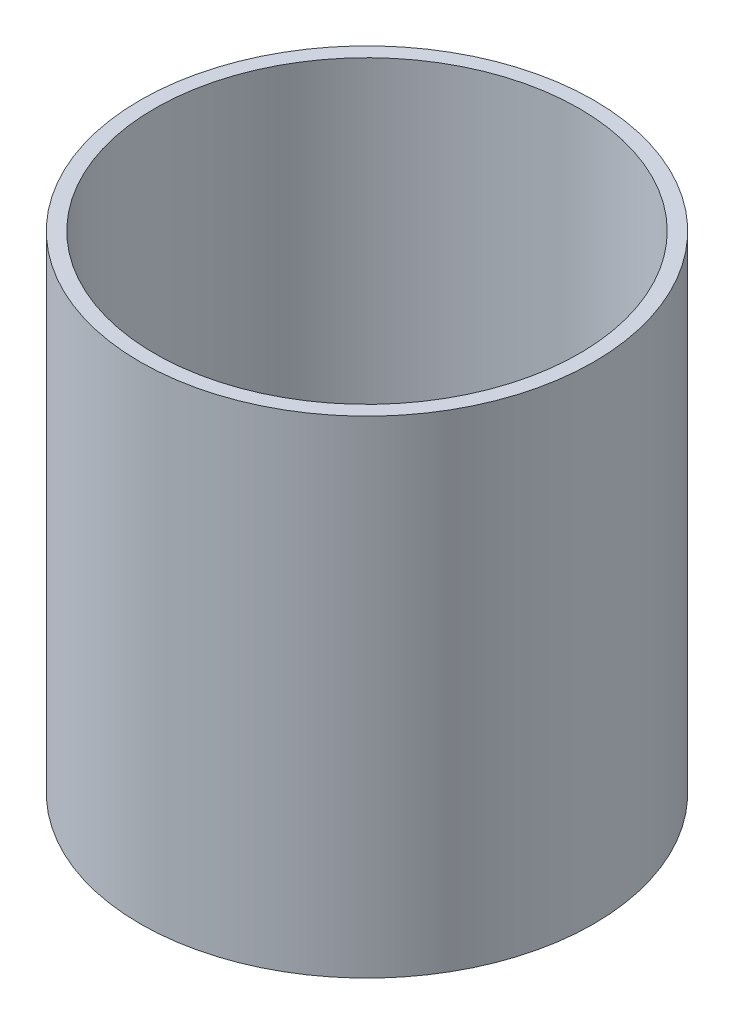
ISO-10303-21;
HEADER;
FILE_DESCRIPTION(('STEP AP214'),'2;1');
FILE_NAME('part.step','',(''),(''),'','','');
FILE_SCHEMA(('AUTOMOTIVE_DESIGN { 1 0 10303 214 1 1 1 1 }'));
ENDSEC;
DATA;
#1=APPLICATION_CONTEXT('core data for automotive mechanical design processes');
#2=APPLICATION_PROTOCOL_DEFINITION('international standard','automotive_design',2000,#1);
#3=PRODUCT_CONTEXT('',#1,'mechanical');
#4=PRODUCT('Part','Part','',(#3));
#5=PRODUCT_RELATED_PRODUCT_CATEGORY('part','',(#4));
#6=PRODUCT_DEFINITION_FORMATION('','',#4);
#7=PRODUCT_DEFINITION_CONTEXT('part definition',#1,'design');
#8=PRODUCT_DEFINITION('design','',#6,#7);
#9=PRODUCT_DEFINITION_SHAPE('','',#8);
#10=(LENGTH_UNIT() NAMED_UNIT(*) SI_UNIT(.MILLI.,.METRE.));
#11=(NAMED_UNIT(*) PLANE_ANGLE_UNIT() SI_UNIT($,.RADIAN.));
#12=(NAMED_UNIT(*) SI_UNIT($,.STERADIAN.) SOLID_ANGLE_UNIT());
#13=UNCERTAINTY_MEASURE_WITH_UNIT(LENGTH_MEASURE(1.E-05),#10,'distance_accuracy_value','');
#14=(GEOMETRIC_REPRESENTATION_CONTEXT(3) GLOBAL_UNCERTAINTY_ASSIGNED_CONTEXT((#13)) GLOBAL_UNIT_ASSIGNED_CONTEXT((#10,
#11,#12)) REPRESENTATION_CONTEXT('',''));
#15=CARTESIAN_POINT('',(0.,0.,0.));
#16=DIRECTION('',(0.,0.,1.));
#17=DIRECTION('',(1.,0.,0.));
#18=AXIS2_PLACEMENT_3D('',#15,#16,#17);
#19=CARTESIAN_POINT('',(0.,44.831,0.));
#20=DIRECTION('',(0.,-1.,0.));
#21=DIRECTION('',(0.,0.,-1.));
#22=AXIS2_PLACEMENT_3D('',#19,#20,#21);
#23=CYLINDRICAL_SURFACE('',#22,20.8915);
#24=CARTESIAN_POINT('',(0.,44.831,0.));
#25=DIRECTION('',(0.,1.,0.));
#26=DIRECTION('',(0.,0.,1.));
#27=AXIS2_PLACEMENT_3D('',#24,#25,#26);
#28=CIRCLE('',#27,20.8915);
#29=CARTESIAN_POINT('',(0.,44.831,-20.8915));
#30=VERTEX_POINT('',#29);
#31=EDGE_CURVE('E10',#30,#30,#28,.T.);
#32=CARTESIAN_POINT('',(0.,0.,0.));
#33=DIRECTION('',(0.,1.,0.));
#34=DIRECTION('',(0.,0.,1.));
#35=AXIS2_PLACEMENT_3D('',#32,#33,#34);
#36=CIRCLE('',#35,20.8915);
#37=CARTESIAN_POINT('',(0.,0.,-20.8915));
#38=VERTEX_POINT('',#37);
#39=EDGE_CURVE('E40',#38,#38,#36,.T.);
#40=CARTESIAN_POINT('',(0.,44.831,-20.8915));
#41=CARTESIAN_POINT('',(0.,44.3640104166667,-20.8915));
#42=CARTESIAN_POINT('',(0.,43.8970208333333,-20.8915));
#43=CARTESIAN_POINT('',(0.,42.9630416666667,-20.8915));
#44=CARTESIAN_POINT('',(0.,42.4960520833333,-20.8915));
#45=CARTESIAN_POINT('',(0.,41.5620729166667,-20.8915));
#46=CARTESIAN_POINT('',(0.,41.0950833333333,-20.8915));
#47=CARTESIAN_POINT('',(0.,40.1611041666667,-20.8915));
#48=CARTESIAN_POINT('',(0.,39.6941145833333,-20.8915));
#49=CARTESIAN_POINT('',(0.,38.7601354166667,-20.8915));
#50=CARTESIAN_POINT('',(0.,38.2931458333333,-20.8915));
#51=CARTESIAN_POINT('',(0.,37.3591666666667,-20.8915));
#52=CARTESIAN_POINT('',(0.,36.8921770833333,-20.8915));
#53=CARTESIAN_POINT('',(0.,35.9581979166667,-20.8915));
#54=CARTESIAN_POINT('',(0.,35.4912083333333,-20.8915));
#55=CARTESIAN_POINT('',(0.,34.5572291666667,-20.8915));
#56=CARTESIAN_POINT('',(0.,34.0902395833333,-20.8915));
#57=CARTESIAN_POINT('',(0.,33.1562604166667,-20.8915));
#58=CARTESIAN_POINT('',(0.,32.6892708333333,-20.8915));
#59=CARTESIAN_POINT('',(0.,31.7552916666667,-20.8915));
#60=CARTESIAN_POINT('',(0.,31.2883020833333,-20.8915));
#61=CARTESIAN_POINT('',(0.,30.3543229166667,-20.8915));
#62=CARTESIAN_POINT('',(0.,29.8873333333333,-20.8915));
#63=CARTESIAN_POINT('',(0.,28.9533541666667,-20.8915));
#64=CARTESIAN_POINT('',(0.,28.4863645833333,-20.8915));
#65=CARTESIAN_POINT('',(0.,27.5523854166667,-20.8915));
#66=CARTESIAN_POINT('',(0.,27.0853958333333,-20.8915));
#67=CARTESIAN_POINT('',(0.,26.1514166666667,-20.8915));
#68=CARTESIAN_POINT('',(0.,25.6844270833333,-20.8915));
#69=CARTESIAN_POINT('',(0.,24.7504479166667,-20.8915));
#70=CARTESIAN_POINT('',(0.,24.2834583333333,-20.8915));
#71=CARTESIAN_POINT('',(0.,23.3494791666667,-20.8915));
#72=CARTESIAN_POINT('',(0.,22.8824895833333,-20.8915));
#73=CARTESIAN_POINT('',(0.,21.9485104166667,-20.8915));
#74=CARTESIAN_POINT('',(0.,21.4815208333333,-20.8915));
#75=CARTESIAN_POINT('',(0.,20.5475416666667,-20.8915));
#76=CARTESIAN_POINT('',(0.,20.0805520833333,-20.8915));
#77=CARTESIAN_POINT('',(0.,19.1465729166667,-20.8915));
#78=CARTESIAN_POINT('',(0.,18.6795833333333,-20.8915));
#79=CARTESIAN_POINT('',(0.,17.7456041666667,-20.8915));
#80=CARTESIAN_POINT('',(0.,17.2786145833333,-20.8915));
#81=CARTESIAN_POINT('',(0.,16.3446354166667,-20.8915));
#82=CARTESIAN_POINT('',(0.,15.8776458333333,-20.8915));
#83=CARTESIAN_POINT('',(0.,14.9436666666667,-20.8915));
#84=CARTESIAN_POINT('',(0.,14.4766770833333,-20.8915));
#85=CARTESIAN_POINT('',(0.,13.5426979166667,-20.8915));
#86=CARTESIAN_POINT('',(0.,13.0757083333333,-20.8915));
#87=CARTESIAN_POINT('',(0.,12.1417291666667,-20.8915));
#88=CARTESIAN_POINT('',(0.,11.6747395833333,-20.8915));
#89=CARTESIAN_POINT('',(0.,10.7407604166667,-20.8915));
#90=CARTESIAN_POINT('',(0.,10.2737708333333,-20.8915));
#91=CARTESIAN_POINT('',(0.,9.33979166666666,-20.8915));
#92=CARTESIAN_POINT('',(0.,8.87280208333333,-20.8915));
#93=CARTESIAN_POINT('',(0.,7.93882291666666,-20.8915));
#94=CARTESIAN_POINT('',(0.,7.47183333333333,-20.8915));
#95=CARTESIAN_POINT('',(0.,6.53785416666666,-20.8915));
#96=CARTESIAN_POINT('',(0.,6.07086458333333,-20.8915));
#97=CARTESIAN_POINT('',(0.,5.13688541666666,-20.8915));
#98=CARTESIAN_POINT('',(0.,4.66989583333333,-20.8915));
#99=CARTESIAN_POINT('',(0.,3.73591666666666,-20.8915));
#100=CARTESIAN_POINT('',(0.,3.26892708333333,-20.8915));
#101=CARTESIAN_POINT('',(0.,2.33494791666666,-20.8915));
#102=CARTESIAN_POINT('',(0.,1.86795833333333,-20.8915));
#103=CARTESIAN_POINT('',(0.,0.933979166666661,-20.8915));
#104=CARTESIAN_POINT('',(0.,0.466989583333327,-20.8915));
#105=CARTESIAN_POINT('',(0.,0.,-20.8915));
#106=B_SPLINE_CURVE_WITH_KNOTS('',3,(#40,#41,#42,#43,#44,#45,#46,#47,#48,#49,#50,#51,#52,#53,
#54,#55,#56,#57,#58,#59,#60,#61,#62,#63,#64,#65,#66,#67,#68,#69,#70,#71,#72,#73,#74,#75,#76,#77,
#78,#79,#80,#81,#82,#83,#84,#85,#86,#87,#88,#89,#90,#91,#92,#93,#94,#95,#96,#97,#98,#99,#100,
#101,#102,#103,#104,#105),.UNSPECIFIED.,.F.,.F.,(4,2,2,2,2,2,2,2,2,2,2,2,2,2,2,2,2,2,2,2,2,2,2,
2,2,2,2,2,2,2,2,2,4),(0.,1.40096875,2.8019375,4.20290625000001,5.603875,7.00484375,
8.40581250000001,9.80678125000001,11.20775,12.60871875,14.0096875,15.41065625,16.811625,
18.21259375,19.6135625,21.01453125,22.4155,23.81646875,25.2174375,26.61840625,28.019375,
29.42034375,30.8213125,32.22228125,33.62325,35.02421875,36.4251875,37.82615625,39.227125,
40.62809375,42.0290625,43.43003125,44.831),.UNSPECIFIED.);
#107=EDGE_CURVE('BSEAM34',#30,#38,#106,.T.);
#108=ORIENTED_EDGE('',*,*,#31,.F.);
#109=ORIENTED_EDGE('',*,*,#39,.T.);
#110=ORIENTED_EDGE('',*,*,#107,.T.);
#111=ORIENTED_EDGE('',*,*,#107,.F.);
#112=EDGE_LOOP('',(#108,#110,#109,#111));
#113=FACE_BOUND('',#112,.T.);
#114=ADVANCED_FACE('F34',(#113),#23,.T.);
#115=CARTESIAN_POINT('',(0.,44.831,0.));
#116=DIRECTION('',(0.,1.,0.));
#117=DIRECTION('',(0.,0.,1.));
#118=AXIS2_PLACEMENT_3D('',#115,#116,#117);
#119=PLANE('',#118);
#120=CARTESIAN_POINT('',(0.,44.831,0.));
#121=DIRECTION('',(0.,-1.,0.));
#122=DIRECTION('',(0.,0.,-1.));
#123=AXIS2_PLACEMENT_3D('',#120,#121,#122);
#124=CIRCLE('',#123,19.558);
#125=CARTESIAN_POINT('',(0.,44.831,-19.558));
#126=VERTEX_POINT('',#125);
#127=EDGE_CURVE('E44',#126,#126,#124,.T.);
#128=ORIENTED_EDGE('',*,*,#127,.T.);
#129=EDGE_LOOP('',(#128));
#130=FACE_BOUND('',#129,.T.);
#131=ORIENTED_EDGE('',*,*,#31,.T.);
#132=EDGE_LOOP('',(#131));
#133=FACE_BOUND('',#132,.T.);
#134=ADVANCED_FACE('F59',(#130,#133),#119,.T.);
#135=CARTESIAN_POINT('',(0.,0.,0.));
#136=DIRECTION('',(0.,1.,0.));
#137=DIRECTION('',(0.,0.,1.));
#138=AXIS2_PLACEMENT_3D('',#135,#136,#137);
#139=PLANE('',#138);
#140=CARTESIAN_POINT('',(0.,0.,0.));
#141=DIRECTION('',(0.,-1.,0.));
#142=DIRECTION('',(0.,0.,-1.));
#143=AXIS2_PLACEMENT_3D('',#140,#141,#142);
#144=CIRCLE('',#143,19.558);
#145=CARTESIAN_POINT('',(0.,0.,-19.558));
#146=VERTEX_POINT('',#145);
#147=EDGE_CURVE('E48',#146,#146,#144,.T.);
#148=ORIENTED_EDGE('',*,*,#147,.F.);
#149=EDGE_LOOP('',(#148));
#150=FACE_BOUND('',#149,.T.);
#151=ORIENTED_EDGE('',*,*,#39,.F.);
#152=EDGE_LOOP('',(#151));
#153=FACE_BOUND('',#152,.T.);
#154=ADVANCED_FACE('F56',(#150,#153),#139,.F.);
#155=CARTESIAN_POINT('',(0.,44.831,0.));
#156=DIRECTION('',(0.,-1.,0.));
#157=DIRECTION('',(0.,0.,-1.));
#158=AXIS2_PLACEMENT_3D('',#155,#156,#157);
#159=CYLINDRICAL_SURFACE('',#158,19.558);
#160=CARTESIAN_POINT('',(0.,44.831,-19.558));
#161=CARTESIAN_POINT('',(0.,44.3640104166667,-19.558));
#162=CARTESIAN_POINT('',(0.,43.8970208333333,-19.558));
#163=CARTESIAN_POINT('',(0.,42.9630416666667,-19.558));
#164=CARTESIAN_POINT('',(0.,42.4960520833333,-19.558));
#165=CARTESIAN_POINT('',(0.,41.5620729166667,-19.558));
#166=CARTESIAN_POINT('',(0.,41.0950833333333,-19.558));
#167=CARTESIAN_POINT('',(0.,40.1611041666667,-19.558));
#168=CARTESIAN_POINT('',(0.,39.6941145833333,-19.558));
#169=CARTESIAN_POINT('',(0.,38.7601354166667,-19.558));
#170=CARTESIAN_POINT('',(0.,38.2931458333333,-19.558));
#171=CARTESIAN_POINT('',(0.,37.3591666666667,-19.558));
#172=CARTESIAN_POINT('',(0.,36.8921770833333,-19.558));
#173=CARTESIAN_POINT('',(0.,35.9581979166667,-19.558));
#174=CARTESIAN_POINT('',(0.,35.4912083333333,-19.558));
#175=CARTESIAN_POINT('',(0.,34.5572291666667,-19.558));
#176=CARTESIAN_POINT('',(0.,34.0902395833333,-19.558));
#177=CARTESIAN_POINT('',(0.,33.1562604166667,-19.558));
#178=CARTESIAN_POINT('',(0.,32.6892708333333,-19.558));
#179=CARTESIAN_POINT('',(0.,31.7552916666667,-19.558));
#180=CARTESIAN_POINT('',(0.,31.2883020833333,-19.558));
#181=CARTESIAN_POINT('',(0.,30.3543229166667,-19.558));
#182=CARTESIAN_POINT('',(0.,29.8873333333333,-19.558));
#183=CARTESIAN_POINT('',(0.,28.9533541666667,-19.558));
#184=CARTESIAN_POINT('',(0.,28.4863645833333,-19.558));
#185=CARTESIAN_POINT('',(0.,27.5523854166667,-19.558));
#186=CARTESIAN_POINT('',(0.,27.0853958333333,-19.558));
#187=CARTESIAN_POINT('',(0.,26.1514166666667,-19.558));
#188=CARTESIAN_POINT('',(0.,25.6844270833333,-19.558));
#189=CARTESIAN_POINT('',(0.,24.7504479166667,-19.558));
#190=CARTESIAN_POINT('',(0.,24.2834583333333,-19.558));
#191=CARTESIAN_POINT('',(0.,23.3494791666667,-19.558));
#192=CARTESIAN_POINT('',(0.,22.8824895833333,-19.558));
#193=CARTESIAN_POINT('',(0.,21.9485104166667,-19.558));
#194=CARTESIAN_POINT('',(0.,21.4815208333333,-19.558));
#195=CARTESIAN_POINT('',(0.,20.5475416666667,-19.558));
#196=CARTESIAN_POINT('',(0.,20.0805520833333,-19.558));
#197=CARTESIAN_POINT('',(0.,19.1465729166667,-19.558));
#198=CARTESIAN_POINT('',(0.,18.6795833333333,-19.558));
#199=CARTESIAN_POINT('',(0.,17.7456041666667,-19.558));
#200=CARTESIAN_POINT('',(0.,17.2786145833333,-19.558));
#201=CARTESIAN_POINT('',(0.,16.3446354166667,-19.558));
#202=CARTESIAN_POINT('',(0.,15.8776458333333,-19.558));
#203=CARTESIAN_POINT('',(0.,14.9436666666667,-19.558));
#204=CARTESIAN_POINT('',(0.,14.4766770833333,-19.558));
#205=CARTESIAN_POINT('',(0.,13.5426979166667,-19.558));
#206=CARTESIAN_POINT('',(0.,13.0757083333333,-19.558));
#207=CARTESIAN_POINT('',(0.,12.1417291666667,-19.558));
#208=CARTESIAN_POINT('',(0.,11.6747395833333,-19.558));
#209=CARTESIAN_POINT('',(0.,10.7407604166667,-19.558));
#210=CARTESIAN_POINT('',(0.,10.2737708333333,-19.558));
#211=CARTESIAN_POINT('',(0.,9.33979166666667,-19.558));
#212=CARTESIAN_POINT('',(0.,8.87280208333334,-19.558));
#213=CARTESIAN_POINT('',(0.,7.93882291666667,-19.558));
#214=CARTESIAN_POINT('',(0.,7.47183333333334,-19.558));
#215=CARTESIAN_POINT('',(0.,6.53785416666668,-19.558));
#216=CARTESIAN_POINT('',(0.,6.07086458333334,-19.558));
#217=CARTESIAN_POINT('',(0.,5.13688541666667,-19.558));
#218=CARTESIAN_POINT('',(0.,4.66989583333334,-19.558));
#219=CARTESIAN_POINT('',(0.,3.73591666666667,-19.558));
#220=CARTESIAN_POINT('',(0.,3.26892708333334,-19.558));
#221=CARTESIAN_POINT('',(0.,2.33494791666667,-19.558));
#222=CARTESIAN_POINT('',(0.,1.86795833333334,-19.558));
#223=CARTESIAN_POINT('',(0.,0.933979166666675,-19.558));
#224=CARTESIAN_POINT('',(0.,0.466989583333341,-19.558));
#225=CARTESIAN_POINT('',(0.,0.,-19.558));
#226=B_SPLINE_CURVE_WITH_KNOTS('',3,(#160,#161,#162,#163,#164,#165,#166,#167,#168,#169,#170,
#171,#172,#173,#174,#175,#176,#177,#178,#179,#180,#181,#182,#183,#184,#185,#186,#187,#188,#189,
#190,#191,#192,#193,#194,#195,#196,#197,#198,#199,#200,#201,#202,#203,#204,#205,#206,#207,#208,
#209,#210,#211,#212,#213,#214,#215,#216,#217,#218,#219,#220,#221,#222,#223,#224,#225),
.UNSPECIFIED.,.F.,.F.,(4,2,2,2,2,2,2,2,2,2,2,2,2,2,2,2,2,2,2,2,2,2,2,2,2,2,2,2,2,2,2,2,4),(0.,
1.40096875,2.8019375,4.20290625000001,5.603875,7.00484375,8.40581250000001,9.80678125,11.20775,
12.60871875,14.0096875,15.41065625,16.811625,18.21259375,19.6135625,21.01453125,22.4155,
23.81646875,25.2174375,26.61840625,28.019375,29.42034375,30.8213125,32.22228125,33.62325,
35.02421875,36.4251875,37.82615625,39.227125,40.62809375,42.0290625,43.43003125,44.831),.UNSPECIFIED.);
#227=EDGE_CURVE('BSEAM54',#126,#146,#226,.T.);
#228=ORIENTED_EDGE('',*,*,#127,.F.);
#229=ORIENTED_EDGE('',*,*,#147,.T.);
#230=ORIENTED_EDGE('',*,*,#227,.T.);
#231=ORIENTED_EDGE('',*,*,#227,.F.);
#232=EDGE_LOOP('',(#228,#230,#229,#231));
#233=FACE_BOUND('',#232,.T.);
#234=ADVANCED_FACE('F54',(#233),#159,.F.);
#235=CLOSED_SHELL('',(#114,#134,#154,#234));
#236=MANIFOLD_SOLID_BREP('B2',#235);
#237=ADVANCED_BREP_SHAPE_REPRESENTATION('',(#18,#236),#14);
#238=SHAPE_DEFINITION_REPRESENTATION(#9,#237);
ENDSEC;
END-ISO-10303-21;
